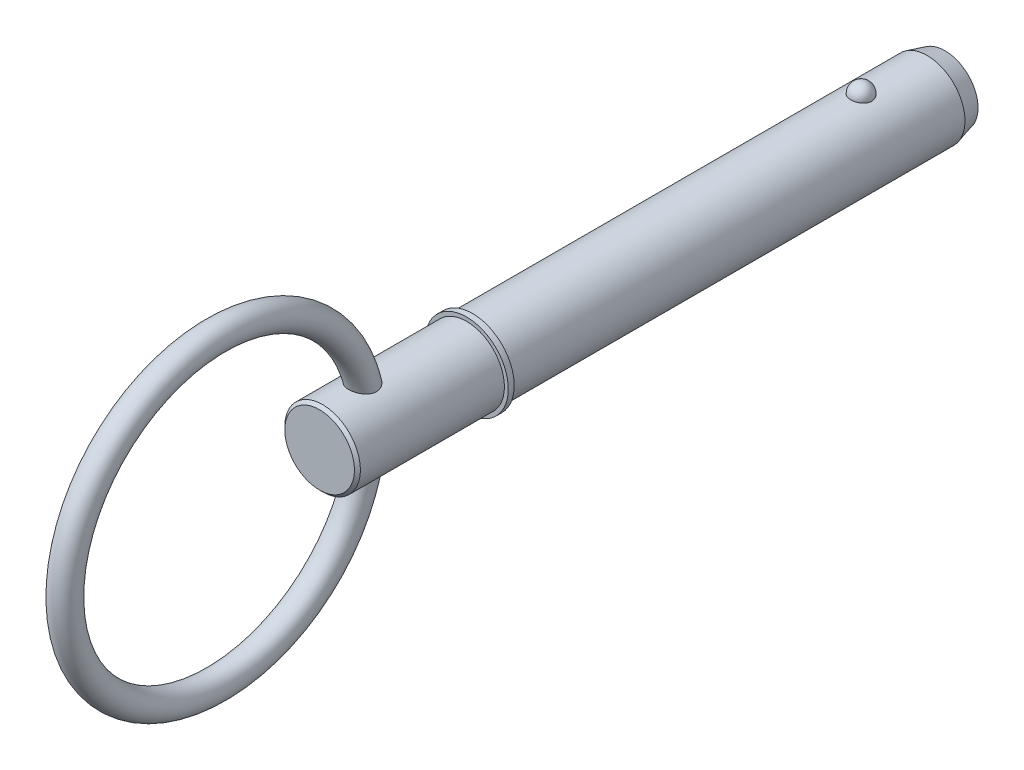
from build123d import *

# Parameters (mm, degrees)
SKETCH2_R           = 6.35
BOSS_EXTRUDE1_DEPTH = 63.5
BOSS_EXTRUDE2_START = 15.88
SKETCH3_R           = 6.35
BOSS_EXTRUDE2_DEPTH = 15.88
CHAMFER1_SIZE       = 3
CHAMFER1_SIZE2      = 0.803847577
SKETCH20_W          = 1
SKETCH20_H          = 7
SKETCH21_R          = 6.35
BOSS_EXTRUDE3_DEPTH = 25.7
CHAMFER2_SIZE       = 0.5
SKETCH24_R          = 2.25


with BuildPart() as part:
    # Sketch2 → Boss-Extrude1 (new body)
    with BuildSketch(Plane.XY):
        Circle(SKETCH2_R)
    extrude(amount=BOSS_EXTRUDE1_DEPTH)

    # Sketch3 → Boss-Extrude2 (add)
    with BuildSketch(Plane(origin=(0, 0, 0), x_dir=(-1, 0, 0), z_dir=(0, 0, -1)).offset(BOSS_EXTRUDE2_START)):
        Circle(SKETCH3_R)
    extrude(amount=-BOSS_EXTRUDE2_DEPTH)

    # Chamfer1
    chamfer1_edges = [part.edges().sort_by_distance(p)[0] for p in [
        (6.35, 0, -15.88),
    ]]
    chamfer1_side = [part.faces().sort_by_distance(p)[0] for p in [
        (6.35, 0, -7.94),
    ]]
    chamfer(chamfer1_edges, length=CHAMFER1_SIZE, length2=CHAMFER1_SIZE2, reference=chamfer1_side[0])

    # Sketch18 → Revolve1 (revolve)
    with BuildSketch(Plane(origin=(0, 0, 0), x_dir=(0, 0, -1), z_dir=(1, 0, 0))):
        with BuildLine():
            Line((1.78, 8.13), (1.78, 4.57))
            ThreePointArc((1.78, 4.57), (0, 6.35), (1.78, 8.13))
        make_face()
    revolve(axis=Axis((0, 8.13, -1.78), (0, -1, 0)))

    # Sketch20 → Revolve2 (revolve)
    with BuildSketch(Plane(origin=(0, 0, 0), x_dir=(0, 0, -1), z_dir=(1, 0, 0)), mode=Mode.PRIVATE) as revolve2_sk:
        with Locations((-64, 3.5)):
            Rectangle(SKETCH20_W, SKETCH20_H)
    revolve(revolve2_sk.sketch.rotate(Axis((0, 0, 33.728787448), (0, 0, 1)), 90), axis=Axis((0, 0, 33.728787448), (0, 0, 1)))

    # Sketch21 → Boss-Extrude3 (add)
    with BuildSketch(Plane(origin=(0, 0, 63.5), x_dir=(-1, 0, 0), z_dir=(0, 0, -1))):
        Circle(SKETCH21_R)
    extrude(amount=-BOSS_EXTRUDE3_DEPTH)

    # Chamfer2
    chamfer2_edges = [part.edges().sort_by_distance(p)[0] for p in [
        (6.35, 0, 89.2),
    ]]
    chamfer(chamfer2_edges, length=CHAMFER2_SIZE)

    # Sweep1: sweep along a path in Sketch23
    with BuildLine(Plane(origin=(0, 0, 0), x_dir=(0, 0, -1), z_dir=(1, 0, 0))) as sweep1_path:
        CenterArc((-106.6, 0), 25.4, 0, 360)
    # Sketch24 → Sweep1 (sweep)
    with BuildSketch(Plane(origin=(0, 0, 0), x_dir=(1, 0, 0), z_dir=(0, 1, 0))):
        with Locations((0, -81.2)):
            Circle(SKETCH24_R)
    sweep(path=sweep1_path.line)


solid = part.part
